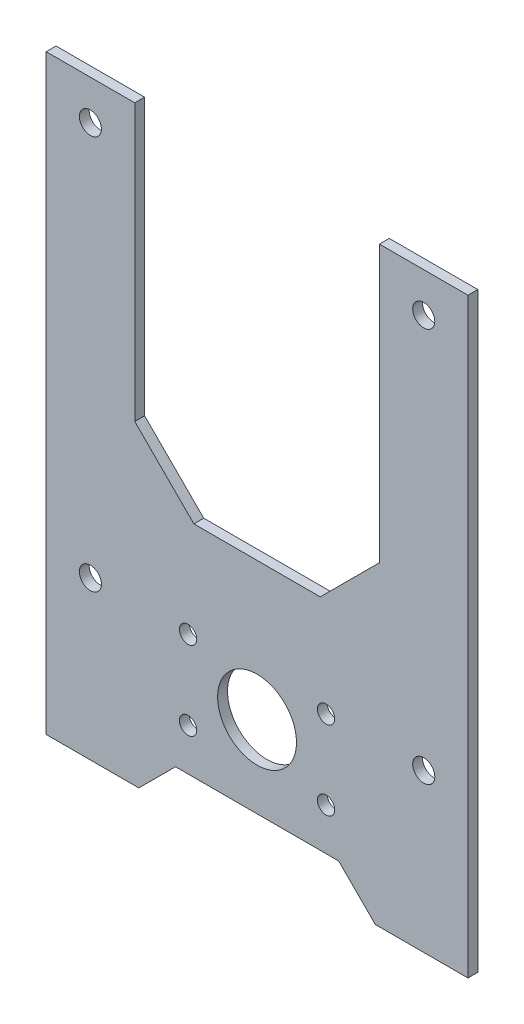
ISO-10303-21;
HEADER;
FILE_DESCRIPTION(('STEP AP214'),'2;1');
FILE_NAME('part.step','',(''),(''),'','','');
FILE_SCHEMA(('AUTOMOTIVE_DESIGN { 1 0 10303 214 1 1 1 1 }'));
ENDSEC;
DATA;
#1=APPLICATION_CONTEXT('core data for automotive mechanical design processes');
#2=APPLICATION_PROTOCOL_DEFINITION('international standard','automotive_design',2000,#1);
#3=PRODUCT_CONTEXT('',#1,'mechanical');
#4=PRODUCT('Part','Part','',(#3));
#5=PRODUCT_RELATED_PRODUCT_CATEGORY('part','',(#4));
#6=PRODUCT_DEFINITION_FORMATION('','',#4);
#7=PRODUCT_DEFINITION_CONTEXT('part definition',#1,'design');
#8=PRODUCT_DEFINITION('design','',#6,#7);
#9=PRODUCT_DEFINITION_SHAPE('','',#8);
#10=(LENGTH_UNIT() NAMED_UNIT(*) SI_UNIT(.MILLI.,.METRE.));
#11=(NAMED_UNIT(*) PLANE_ANGLE_UNIT() SI_UNIT($,.RADIAN.));
#12=(NAMED_UNIT(*) SI_UNIT($,.STERADIAN.) SOLID_ANGLE_UNIT());
#13=UNCERTAINTY_MEASURE_WITH_UNIT(LENGTH_MEASURE(1.E-05),#10,'distance_accuracy_value','');
#14=(GEOMETRIC_REPRESENTATION_CONTEXT(3) GLOBAL_UNCERTAINTY_ASSIGNED_CONTEXT((#13)) GLOBAL_UNIT_ASSIGNED_CONTEXT((#10,
#11,#12)) REPRESENTATION_CONTEXT('',''));
#15=CARTESIAN_POINT('',(0.,0.,0.));
#16=DIRECTION('',(0.,0.,1.));
#17=DIRECTION('',(1.,0.,0.));
#18=AXIS2_PLACEMENT_3D('',#15,#16,#17);
#19=CARTESIAN_POINT('',(-33.9725,-47.625,-1.5875));
#20=DIRECTION('',(0.,-1.,0.));
#21=DIRECTION('',(0.,0.,-1.));
#22=AXIS2_PLACEMENT_3D('',#19,#20,#21);
#23=PLANE('',#22);
#24=DIRECTION('',(1.,0.,0.));
#25=VECTOR('',#24,1.);
#26=CARTESIAN_POINT('',(-33.9725,-47.625,0.));
#27=LINE('',#26,#25);
#28=CARTESIAN_POINT('',(19.05,-47.6249999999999,0.));
#29=VERTEX_POINT('',#28);
#30=CARTESIAN_POINT('',(33.9725,-47.625,0.));
#31=VERTEX_POINT('',#30);
#32=EDGE_CURVE('E242',#29,#31,#27,.T.);
#33=ORIENTED_EDGE('',*,*,#32,.F.);
#34=DIRECTION('',(0.,0.,1.));
#35=VECTOR('',#34,1.);
#36=CARTESIAN_POINT('',(19.05,-47.6249999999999,-1.587512));
#37=LINE('',#36,#35);
#38=CARTESIAN_POINT('',(19.05,-47.6249999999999,-1.5875));
#39=VERTEX_POINT('',#38);
#40=EDGE_CURVE('E165',#39,#29,#37,.T.);
#41=ORIENTED_EDGE('',*,*,#40,.F.);
#42=DIRECTION('',(1.,0.,0.));
#43=VECTOR('',#42,1.);
#44=CARTESIAN_POINT('',(-33.9725,-47.625,-1.5875));
#45=LINE('',#44,#43);
#46=CARTESIAN_POINT('',(33.9725,-47.625,-1.5875));
#47=VERTEX_POINT('',#46);
#48=EDGE_CURVE('E228',#39,#47,#45,.T.);
#49=ORIENTED_EDGE('',*,*,#48,.T.);
#50=DIRECTION('',(0.,0.,1.));
#51=VECTOR('',#50,1.);
#52=CARTESIAN_POINT('',(33.9725,-47.625,-1.5875));
#53=LINE('',#52,#51);
#54=EDGE_CURVE('E245',#47,#31,#53,.T.);
#55=ORIENTED_EDGE('',*,*,#54,.T.);
#56=EDGE_LOOP('',(#33,#41,#49,#55));
#57=FACE_BOUND('',#56,.T.);
#58=ADVANCED_FACE('F40',(#57),#23,.T.);
#59=CARTESIAN_POINT('',(-33.9725,-47.625,-1.5875));
#60=VERTEX_POINT('',#59);
#61=CARTESIAN_POINT('',(-19.05,-47.6249999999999,-1.5875));
#62=VERTEX_POINT('',#61);
#63=EDGE_CURVE('E229',#60,#62,#45,.T.);
#64=ORIENTED_EDGE('',*,*,#63,.T.);
#65=DIRECTION('',(0.,0.,1.));
#66=VECTOR('',#65,1.);
#67=CARTESIAN_POINT('',(-19.05,-47.6249999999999,-1.587512));
#68=LINE('',#67,#66);
#69=CARTESIAN_POINT('',(-19.05,-47.6249999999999,0.));
#70=VERTEX_POINT('',#69);
#71=EDGE_CURVE('E275',#62,#70,#68,.T.);
#72=ORIENTED_EDGE('',*,*,#71,.T.);
#73=CARTESIAN_POINT('',(-33.9725,-47.625,0.));
#74=VERTEX_POINT('',#73);
#75=EDGE_CURVE('E221',#74,#70,#27,.T.);
#76=ORIENTED_EDGE('',*,*,#75,.F.);
#77=DIRECTION('',(0.,0.,1.));
#78=VECTOR('',#77,1.);
#79=CARTESIAN_POINT('',(-33.9725,-47.625,-1.5875));
#80=LINE('',#79,#78);
#81=EDGE_CURVE('E248',#60,#74,#80,.T.);
#82=ORIENTED_EDGE('',*,*,#81,.F.);
#83=EDGE_LOOP('',(#64,#72,#76,#82));
#84=FACE_BOUND('',#83,.T.);
#85=ADVANCED_FACE('F277',(#84),#23,.T.);
#86=CARTESIAN_POINT('',(-33.9725,47.625,-1.5875));
#87=DIRECTION('',(0.,1.,0.));
#88=DIRECTION('',(0.,0.,1.));
#89=AXIS2_PLACEMENT_3D('',#86,#87,#88);
#90=PLANE('',#89);
#91=DIRECTION('',(-1.,0.,0.));
#92=VECTOR('',#91,1.);
#93=CARTESIAN_POINT('',(-33.9725,47.625,-1.5875));
#94=LINE('',#93,#92);
#95=CARTESIAN_POINT('',(33.9725,47.625,-1.5875));
#96=VERTEX_POINT('',#95);
#97=CARTESIAN_POINT('',(19.7040499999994,47.625,-1.5875));
#98=VERTEX_POINT('',#97);
#99=EDGE_CURVE('E222',#96,#98,#94,.T.);
#100=ORIENTED_EDGE('',*,*,#99,.T.);
#101=DIRECTION('',(0.,0.,1.));
#102=VECTOR('',#101,1.);
#103=CARTESIAN_POINT('',(19.7040499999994,47.625,-1.587512));
#104=LINE('',#103,#102);
#105=CARTESIAN_POINT('',(19.7040499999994,47.625,0.));
#106=VERTEX_POINT('',#105);
#107=EDGE_CURVE('E168',#98,#106,#104,.T.);
#108=ORIENTED_EDGE('',*,*,#107,.T.);
#109=DIRECTION('',(-1.,0.,0.));
#110=VECTOR('',#109,1.);
#111=CARTESIAN_POINT('',(-33.9725,47.625,0.));
#112=LINE('',#111,#110);
#113=CARTESIAN_POINT('',(33.9725,47.625,0.));
#114=VERTEX_POINT('',#113);
#115=EDGE_CURVE('E236',#114,#106,#112,.T.);
#116=ORIENTED_EDGE('',*,*,#115,.F.);
#117=DIRECTION('',(0.,0.,1.));
#118=VECTOR('',#117,1.);
#119=CARTESIAN_POINT('',(33.9725,47.625,-1.5875));
#120=LINE('',#119,#118);
#121=EDGE_CURVE('E232',#96,#114,#120,.T.);
#122=ORIENTED_EDGE('',*,*,#121,.F.);
#123=EDGE_LOOP('',(#100,#108,#116,#122));
#124=FACE_BOUND('',#123,.T.);
#125=ADVANCED_FACE('F297',(#124),#90,.T.);
#126=CARTESIAN_POINT('',(-19.7040499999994,47.625,0.));
#127=VERTEX_POINT('',#126);
#128=CARTESIAN_POINT('',(-33.9725,47.625,0.));
#129=VERTEX_POINT('',#128);
#130=EDGE_CURVE('E235',#127,#129,#112,.T.);
#131=ORIENTED_EDGE('',*,*,#130,.F.);
#132=DIRECTION('',(0.,0.,1.));
#133=VECTOR('',#132,1.);
#134=CARTESIAN_POINT('',(-19.7040499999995,47.625,-1.587512));
#135=LINE('',#134,#133);
#136=CARTESIAN_POINT('',(-19.7040499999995,47.625,-1.5875));
#137=VERTEX_POINT('',#136);
#138=EDGE_CURVE('E63',#137,#127,#135,.T.);
#139=ORIENTED_EDGE('',*,*,#138,.F.);
#140=CARTESIAN_POINT('',(-33.9725,47.625,-1.5875));
#141=VERTEX_POINT('',#140);
#142=EDGE_CURVE('E161',#137,#141,#94,.T.);
#143=ORIENTED_EDGE('',*,*,#142,.T.);
#144=DIRECTION('',(0.,0.,1.));
#145=VECTOR('',#144,1.);
#146=CARTESIAN_POINT('',(-33.9725,47.625,-1.5875));
#147=LINE('',#146,#145);
#148=EDGE_CURVE('E250',#141,#129,#147,.T.);
#149=ORIENTED_EDGE('',*,*,#148,.T.);
#150=EDGE_LOOP('',(#131,#139,#143,#149));
#151=FACE_BOUND('',#150,.T.);
#152=ADVANCED_FACE('F334',(#151),#90,.T.);
#153=CARTESIAN_POINT('',(0.,0.,-1.5875));
#154=DIRECTION('',(0.,0.,-1.));
#155=DIRECTION('',(-1.,0.,0.));
#156=AXIS2_PLACEMENT_3D('',#153,#154,#155);
#157=PLANE('',#156);
#158=CARTESIAN_POINT('',(11.1125,-34.925,-1.5875));
#159=DIRECTION('',(0.,0.,1.));
#160=DIRECTION('',(1.,0.,0.));
#161=AXIS2_PLACEMENT_3D('',#158,#159,#160);
#162=CIRCLE('',#161,1.397);
#163=CARTESIAN_POINT('',(12.5095,-34.925,-1.5875));
#164=VERTEX_POINT('',#163);
#165=EDGE_CURVE('E617',#164,#164,#162,.T.);
#166=ORIENTED_EDGE('',*,*,#165,.T.);
#167=EDGE_LOOP('',(#166));
#168=FACE_BOUND('',#167,.T.);
#169=CARTESIAN_POINT('',(-11.1125,-22.225,-1.5875));
#170=DIRECTION('',(0.,0.,1.));
#171=DIRECTION('',(1.,0.,0.));
#172=AXIS2_PLACEMENT_3D('',#169,#170,#171);
#173=CIRCLE('',#172,1.397);
#174=CARTESIAN_POINT('',(-9.7155,-22.225,-1.5875));
#175=VERTEX_POINT('',#174);
#176=EDGE_CURVE('E621',#175,#175,#173,.T.);
#177=ORIENTED_EDGE('',*,*,#176,.T.);
#178=EDGE_LOOP('',(#177));
#179=FACE_BOUND('',#178,.T.);
#180=CARTESIAN_POINT('',(-11.1125,-34.925,-1.5875));
#181=DIRECTION('',(0.,0.,1.));
#182=DIRECTION('',(1.,0.,0.));
#183=AXIS2_PLACEMENT_3D('',#180,#181,#182);
#184=CIRCLE('',#183,1.397);
#185=CARTESIAN_POINT('',(-9.7155,-34.925,-1.5875));
#186=VERTEX_POINT('',#185);
#187=EDGE_CURVE('E632',#186,#186,#184,.T.);
#188=ORIENTED_EDGE('',*,*,#187,.T.);
#189=EDGE_LOOP('',(#188));
#190=FACE_BOUND('',#189,.T.);
#191=CARTESIAN_POINT('',(11.1125,-22.225,-1.5875));
#192=DIRECTION('',(0.,0.,1.));
#193=DIRECTION('',(1.,0.,0.));
#194=AXIS2_PLACEMENT_3D('',#191,#192,#193);
#195=CIRCLE('',#194,1.397);
#196=CARTESIAN_POINT('',(12.5095,-22.225,-1.5875));
#197=VERTEX_POINT('',#196);
#198=EDGE_CURVE('E284',#197,#197,#195,.T.);
#199=ORIENTED_EDGE('',*,*,#198,.T.);
#200=EDGE_LOOP('',(#199));
#201=FACE_BOUND('',#200,.T.);
#202=CARTESIAN_POINT('',(0.,-28.575,-1.5875));
#203=DIRECTION('',(0.,0.,1.));
#204=DIRECTION('',(1.,0.,0.));
#205=AXIS2_PLACEMENT_3D('',#202,#203,#204);
#206=CIRCLE('',#205,6.35);
#207=CARTESIAN_POINT('',(6.35000000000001,-28.575,-1.5875));
#208=VERTEX_POINT('',#207);
#209=EDGE_CURVE('E188',#208,#208,#206,.T.);
#210=ORIENTED_EDGE('',*,*,#209,.T.);
#211=EDGE_LOOP('',(#210));
#212=FACE_BOUND('',#211,.T.);
#213=CARTESIAN_POINT('',(26.8478,41.2750000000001,-1.5875));
#214=DIRECTION('',(0.,0.,1.));
#215=DIRECTION('',(1.,0.,0.));
#216=AXIS2_PLACEMENT_3D('',#213,#214,#215);
#217=CIRCLE('',#216,1.77799999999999);
#218=CARTESIAN_POINT('',(28.6258,41.2750000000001,-1.5875));
#219=VERTEX_POINT('',#218);
#220=EDGE_CURVE('E207',#219,#219,#217,.T.);
#221=ORIENTED_EDGE('',*,*,#220,.T.);
#222=EDGE_LOOP('',(#221));
#223=FACE_BOUND('',#222,.T.);
#224=CARTESIAN_POINT('',(-26.8478,41.2750000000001,-1.5875));
#225=DIRECTION('',(0.,0.,1.));
#226=DIRECTION('',(1.,0.,0.));
#227=AXIS2_PLACEMENT_3D('',#224,#225,#226);
#228=CIRCLE('',#227,1.778);
#229=CARTESIAN_POINT('',(-25.0698,41.2750000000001,-1.5875));
#230=VERTEX_POINT('',#229);
#231=EDGE_CURVE('E201',#230,#230,#228,.T.);
#232=ORIENTED_EDGE('',*,*,#231,.T.);
#233=EDGE_LOOP('',(#232));
#234=FACE_BOUND('',#233,.T.);
#235=CARTESIAN_POINT('',(-26.8478,-22.2249999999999,-1.5875));
#236=DIRECTION('',(0.,0.,1.));
#237=DIRECTION('',(1.,0.,0.));
#238=AXIS2_PLACEMENT_3D('',#235,#236,#237);
#239=CIRCLE('',#238,1.77799999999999);
#240=CARTESIAN_POINT('',(-25.0698,-22.2249999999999,-1.5875));
#241=VERTEX_POINT('',#240);
#242=EDGE_CURVE('E194',#241,#241,#239,.T.);
#243=ORIENTED_EDGE('',*,*,#242,.T.);
#244=EDGE_LOOP('',(#243));
#245=FACE_BOUND('',#244,.T.);
#246=CARTESIAN_POINT('',(26.8478,-22.2249999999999,-1.5875));
#247=DIRECTION('',(0.,0.,1.));
#248=DIRECTION('',(1.,0.,0.));
#249=AXIS2_PLACEMENT_3D('',#246,#247,#248);
#250=CIRCLE('',#249,1.77799999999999);
#251=CARTESIAN_POINT('',(28.6258,-22.2249999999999,-1.5875));
#252=VERTEX_POINT('',#251);
#253=EDGE_CURVE('E212',#252,#252,#250,.T.);
#254=ORIENTED_EDGE('',*,*,#253,.T.);
#255=EDGE_LOOP('',(#254));
#256=FACE_BOUND('',#255,.T.);
#257=ORIENTED_EDGE('',*,*,#48,.F.);
#258=DIRECTION('',(-0.707106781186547,0.707106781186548,0.));
#259=VECTOR('',#258,1.);
#260=CARTESIAN_POINT('',(-14.2875,-14.2874999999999,-1.5875));
#261=LINE('',#260,#259);
#262=CARTESIAN_POINT('',(13.1383466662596,-41.7133466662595,-1.5875));
#263=VERTEX_POINT('',#262);
#264=EDGE_CURVE('E181',#39,#263,#261,.T.);
#265=ORIENTED_EDGE('',*,*,#264,.T.);
#266=DIRECTION('',(-1.,0.,0.));
#267=VECTOR('',#266,1.);
#268=CARTESIAN_POINT('',(0.,-41.7133466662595,-1.5875));
#269=LINE('',#268,#267);
#270=CARTESIAN_POINT('',(-13.1383466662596,-41.7133466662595,-1.5875));
#271=VERTEX_POINT('',#270);
#272=EDGE_CURVE('E184',#263,#271,#269,.T.);
#273=ORIENTED_EDGE('',*,*,#272,.T.);
#274=DIRECTION('',(-0.707106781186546,-0.707106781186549,0.));
#275=VECTOR('',#274,1.);
#276=CARTESIAN_POINT('',(14.2874999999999,-14.2874999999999,-1.5875));
#277=LINE('',#276,#275);
#278=EDGE_CURVE('E178',#271,#62,#277,.T.);
#279=ORIENTED_EDGE('',*,*,#278,.T.);
#280=ORIENTED_EDGE('',*,*,#63,.F.);
#281=DIRECTION('',(0.,-1.,0.));
#282=VECTOR('',#281,1.);
#283=CARTESIAN_POINT('',(-33.9725,-47.625,-1.5875));
#284=LINE('',#283,#282);
#285=EDGE_CURVE('E225',#141,#60,#284,.T.);
#286=ORIENTED_EDGE('',*,*,#285,.F.);
#287=ORIENTED_EDGE('',*,*,#142,.F.);
#288=DIRECTION('',(0.,-1.,0.));
#289=VECTOR('',#288,1.);
#290=CARTESIAN_POINT('',(-19.7040499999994,0.,-1.5875));
#291=LINE('',#290,#289);
#292=CARTESIAN_POINT('',(-19.7040499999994,3.17499999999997,-1.5875));
#293=VERTEX_POINT('',#292);
#294=EDGE_CURVE('E152',#137,#293,#291,.T.);
#295=ORIENTED_EDGE('',*,*,#294,.T.);
#296=DIRECTION('',(0.707106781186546,-0.707106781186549,0.));
#297=VECTOR('',#296,1.);
#298=CARTESIAN_POINT('',(-8.26452499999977,-8.26452499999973,-1.5875));
#299=LINE('',#298,#297);
#300=CARTESIAN_POINT('',(-10.1790499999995,-6.34999999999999,-1.5875));
#301=VERTEX_POINT('',#300);
#302=EDGE_CURVE('E141',#293,#301,#299,.T.);
#303=ORIENTED_EDGE('',*,*,#302,.T.);
#304=DIRECTION('',(1.,0.,0.));
#305=VECTOR('',#304,1.);
#306=CARTESIAN_POINT('',(0.,-6.34999999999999,-1.5875));
#307=LINE('',#306,#305);
#308=CARTESIAN_POINT('',(10.1790499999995,-6.34999999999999,-1.5875));
#309=VERTEX_POINT('',#308);
#310=EDGE_CURVE('E151',#301,#309,#307,.T.);
#311=ORIENTED_EDGE('',*,*,#310,.T.);
#312=DIRECTION('',(0.707106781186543,0.707106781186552,0.));
#313=VECTOR('',#312,1.);
#314=CARTESIAN_POINT('',(8.26452499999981,-8.2645249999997,-1.5875));
#315=LINE('',#314,#313);
#316=CARTESIAN_POINT('',(19.7040499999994,3.175,-1.5875));
#317=VERTEX_POINT('',#316);
#318=EDGE_CURVE('E172',#309,#317,#315,.T.);
#319=ORIENTED_EDGE('',*,*,#318,.T.);
#320=DIRECTION('',(0.,1.,0.));
#321=VECTOR('',#320,1.);
#322=CARTESIAN_POINT('',(19.7040499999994,0.,-1.5875));
#323=LINE('',#322,#321);
#324=EDGE_CURVE('E175',#317,#98,#323,.T.);
#325=ORIENTED_EDGE('',*,*,#324,.T.);
#326=ORIENTED_EDGE('',*,*,#99,.F.);
#327=DIRECTION('',(0.,1.,0.));
#328=VECTOR('',#327,1.);
#329=CARTESIAN_POINT('',(33.9725,-47.625,-1.5875));
#330=LINE('',#329,#328);
#331=EDGE_CURVE('E218',#47,#96,#330,.T.);
#332=ORIENTED_EDGE('',*,*,#331,.F.);
#333=EDGE_LOOP('',(#257,#265,#273,#279,#280,#286,#287,#295,#303,#311,#319,#325,#326,#332));
#334=FACE_BOUND('',#333,.T.);
#335=ADVANCED_FACE('F159',(#168,#179,#190,#201,#212,#223,#234,#245,#256,#334),#157,.T.);
#336=CARTESIAN_POINT('',(0.,0.,0.));
#337=DIRECTION('',(0.,0.,-1.));
#338=DIRECTION('',(-1.,0.,0.));
#339=AXIS2_PLACEMENT_3D('',#336,#337,#338);
#340=PLANE('',#339);
#341=CARTESIAN_POINT('',(11.1125,-34.925,0.));
#342=DIRECTION('',(0.,0.,1.));
#343=DIRECTION('',(1.,0.,0.));
#344=AXIS2_PLACEMENT_3D('',#341,#342,#343);
#345=CIRCLE('',#344,1.397);
#346=CARTESIAN_POINT('',(12.5095,-34.925,0.));
#347=VERTEX_POINT('',#346);
#348=EDGE_CURVE('E620',#347,#347,#345,.T.);
#349=ORIENTED_EDGE('',*,*,#348,.F.);
#350=EDGE_LOOP('',(#349));
#351=FACE_BOUND('',#350,.T.);
#352=CARTESIAN_POINT('',(-11.1125,-22.225,0.));
#353=DIRECTION('',(0.,0.,1.));
#354=DIRECTION('',(1.,0.,0.));
#355=AXIS2_PLACEMENT_3D('',#352,#353,#354);
#356=CIRCLE('',#355,1.397);
#357=CARTESIAN_POINT('',(-9.7155,-22.225,0.));
#358=VERTEX_POINT('',#357);
#359=EDGE_CURVE('E626',#358,#358,#356,.T.);
#360=ORIENTED_EDGE('',*,*,#359,.F.);
#361=EDGE_LOOP('',(#360));
#362=FACE_BOUND('',#361,.T.);
#363=CARTESIAN_POINT('',(-11.1125,-34.925,0.));
#364=DIRECTION('',(0.,0.,1.));
#365=DIRECTION('',(1.,0.,0.));
#366=AXIS2_PLACEMENT_3D('',#363,#364,#365);
#367=CIRCLE('',#366,1.397);
#368=CARTESIAN_POINT('',(-9.7155,-34.925,0.));
#369=VERTEX_POINT('',#368);
#370=EDGE_CURVE('E643',#369,#369,#367,.T.);
#371=ORIENTED_EDGE('',*,*,#370,.F.);
#372=EDGE_LOOP('',(#371));
#373=FACE_BOUND('',#372,.T.);
#374=CARTESIAN_POINT('',(11.1125,-22.225,0.));
#375=DIRECTION('',(0.,0.,1.));
#376=DIRECTION('',(1.,0.,0.));
#377=AXIS2_PLACEMENT_3D('',#374,#375,#376);
#378=CIRCLE('',#377,1.397);
#379=CARTESIAN_POINT('',(12.5095,-22.225,0.));
#380=VERTEX_POINT('',#379);
#381=EDGE_CURVE('E623',#380,#380,#378,.T.);
#382=ORIENTED_EDGE('',*,*,#381,.F.);
#383=EDGE_LOOP('',(#382));
#384=FACE_BOUND('',#383,.T.);
#385=CARTESIAN_POINT('',(0.,-28.575,0.));
#386=DIRECTION('',(0.,0.,1.));
#387=DIRECTION('',(1.,0.,0.));
#388=AXIS2_PLACEMENT_3D('',#385,#386,#387);
#389=CIRCLE('',#388,6.35);
#390=CARTESIAN_POINT('',(6.35000000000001,-28.575,0.));
#391=VERTEX_POINT('',#390);
#392=EDGE_CURVE('E187',#391,#391,#389,.T.);
#393=ORIENTED_EDGE('',*,*,#392,.F.);
#394=EDGE_LOOP('',(#393));
#395=FACE_BOUND('',#394,.T.);
#396=CARTESIAN_POINT('',(26.8478,41.2750000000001,0.));
#397=DIRECTION('',(0.,0.,1.));
#398=DIRECTION('',(1.,0.,0.));
#399=AXIS2_PLACEMENT_3D('',#396,#397,#398);
#400=CIRCLE('',#399,1.77799999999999);
#401=CARTESIAN_POINT('',(28.6258,41.2750000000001,0.));
#402=VERTEX_POINT('',#401);
#403=EDGE_CURVE('E191',#402,#402,#400,.T.);
#404=ORIENTED_EDGE('',*,*,#403,.F.);
#405=EDGE_LOOP('',(#404));
#406=FACE_BOUND('',#405,.T.);
#407=CARTESIAN_POINT('',(-26.8478,41.2750000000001,0.));
#408=DIRECTION('',(0.,0.,1.));
#409=DIRECTION('',(1.,0.,0.));
#410=AXIS2_PLACEMENT_3D('',#407,#408,#409);
#411=CIRCLE('',#410,1.778);
#412=CARTESIAN_POINT('',(-25.0698,41.2750000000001,0.));
#413=VERTEX_POINT('',#412);
#414=EDGE_CURVE('E204',#413,#413,#411,.T.);
#415=ORIENTED_EDGE('',*,*,#414,.F.);
#416=EDGE_LOOP('',(#415));
#417=FACE_BOUND('',#416,.T.);
#418=CARTESIAN_POINT('',(-26.8478,-22.2249999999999,0.));
#419=DIRECTION('',(0.,0.,1.));
#420=DIRECTION('',(1.,0.,0.));
#421=AXIS2_PLACEMENT_3D('',#418,#419,#420);
#422=CIRCLE('',#421,1.77799999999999);
#423=CARTESIAN_POINT('',(-25.0698,-22.2249999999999,0.));
#424=VERTEX_POINT('',#423);
#425=EDGE_CURVE('E198',#424,#424,#422,.T.);
#426=ORIENTED_EDGE('',*,*,#425,.F.);
#427=EDGE_LOOP('',(#426));
#428=FACE_BOUND('',#427,.T.);
#429=CARTESIAN_POINT('',(26.8478,-22.2249999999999,0.));
#430=DIRECTION('',(0.,0.,1.));
#431=DIRECTION('',(1.,0.,0.));
#432=AXIS2_PLACEMENT_3D('',#429,#430,#431);
#433=CIRCLE('',#432,1.77799999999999);
#434=CARTESIAN_POINT('',(28.6258,-22.2249999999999,0.));
#435=VERTEX_POINT('',#434);
#436=EDGE_CURVE('E197',#435,#435,#433,.T.);
#437=ORIENTED_EDGE('',*,*,#436,.F.);
#438=EDGE_LOOP('',(#437));
#439=FACE_BOUND('',#438,.T.);
#440=DIRECTION('',(-0.707106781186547,0.707106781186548,0.));
#441=VECTOR('',#440,1.);
#442=CARTESIAN_POINT('',(-14.2875,-14.2874999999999,0.));
#443=LINE('',#442,#441);
#444=CARTESIAN_POINT('',(13.1383466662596,-41.7133466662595,0.));
#445=VERTEX_POINT('',#444);
#446=EDGE_CURVE('E11',#29,#445,#443,.T.);
#447=ORIENTED_EDGE('',*,*,#446,.F.);
#448=ORIENTED_EDGE('',*,*,#32,.T.);
#449=DIRECTION('',(0.,1.,0.));
#450=VECTOR('',#449,1.);
#451=CARTESIAN_POINT('',(33.9725,-47.625,0.));
#452=LINE('',#451,#450);
#453=EDGE_CURVE('E215',#31,#114,#452,.T.);
#454=ORIENTED_EDGE('',*,*,#453,.T.);
#455=ORIENTED_EDGE('',*,*,#115,.T.);
#456=DIRECTION('',(0.,1.,0.));
#457=VECTOR('',#456,1.);
#458=CARTESIAN_POINT('',(19.7040499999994,0.,0.));
#459=LINE('',#458,#457);
#460=CARTESIAN_POINT('',(19.7040499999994,3.175,0.));
#461=VERTEX_POINT('',#460);
#462=EDGE_CURVE('E261',#461,#106,#459,.T.);
#463=ORIENTED_EDGE('',*,*,#462,.F.);
#464=DIRECTION('',(0.707106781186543,0.707106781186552,0.));
#465=VECTOR('',#464,1.);
#466=CARTESIAN_POINT('',(8.26452499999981,-8.2645249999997,0.));
#467=LINE('',#466,#465);
#468=CARTESIAN_POINT('',(10.1790499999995,-6.34999999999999,0.));
#469=VERTEX_POINT('',#468);
#470=EDGE_CURVE('E259',#469,#461,#467,.T.);
#471=ORIENTED_EDGE('',*,*,#470,.F.);
#472=DIRECTION('',(1.,0.,0.));
#473=VECTOR('',#472,1.);
#474=CARTESIAN_POINT('',(0.,-6.34999999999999,0.));
#475=LINE('',#474,#473);
#476=CARTESIAN_POINT('',(-10.1790499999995,-6.34999999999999,0.));
#477=VERTEX_POINT('',#476);
#478=EDGE_CURVE('E257',#477,#469,#475,.T.);
#479=ORIENTED_EDGE('',*,*,#478,.F.);
#480=DIRECTION('',(0.707106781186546,-0.707106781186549,0.));
#481=VECTOR('',#480,1.);
#482=CARTESIAN_POINT('',(-8.26452499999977,-8.26452499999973,0.));
#483=LINE('',#482,#481);
#484=CARTESIAN_POINT('',(-19.7040499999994,3.17499999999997,0.));
#485=VERTEX_POINT('',#484);
#486=EDGE_CURVE('E255',#485,#477,#483,.T.);
#487=ORIENTED_EDGE('',*,*,#486,.F.);
#488=DIRECTION('',(0.,-1.,0.));
#489=VECTOR('',#488,1.);
#490=CARTESIAN_POINT('',(-19.7040499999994,0.,0.));
#491=LINE('',#490,#489);
#492=EDGE_CURVE('E155',#127,#485,#491,.T.);
#493=ORIENTED_EDGE('',*,*,#492,.F.);
#494=ORIENTED_EDGE('',*,*,#130,.T.);
#495=DIRECTION('',(0.,-1.,0.));
#496=VECTOR('',#495,1.);
#497=CARTESIAN_POINT('',(-33.9725,-47.625,0.));
#498=LINE('',#497,#496);
#499=EDGE_CURVE('E239',#129,#74,#498,.T.);
#500=ORIENTED_EDGE('',*,*,#499,.T.);
#501=ORIENTED_EDGE('',*,*,#75,.T.);
#502=DIRECTION('',(-0.707106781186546,-0.707106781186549,0.));
#503=VECTOR('',#502,1.);
#504=CARTESIAN_POINT('',(14.2874999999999,-14.2874999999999,0.));
#505=LINE('',#504,#503);
#506=CARTESIAN_POINT('',(-13.1383466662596,-41.7133466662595,0.));
#507=VERTEX_POINT('',#506);
#508=EDGE_CURVE('E263',#507,#70,#505,.T.);
#509=ORIENTED_EDGE('',*,*,#508,.F.);
#510=DIRECTION('',(-1.,0.,0.));
#511=VECTOR('',#510,1.);
#512=CARTESIAN_POINT('',(0.,-41.7133466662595,0.));
#513=LINE('',#512,#511);
#514=EDGE_CURVE('E48',#445,#507,#513,.T.);
#515=ORIENTED_EDGE('',*,*,#514,.F.);
#516=EDGE_LOOP('',(#447,#448,#454,#455,#463,#471,#479,#487,#493,#494,#500,#501,#509,#515));
#517=FACE_BOUND('',#516,.T.);
#518=ADVANCED_FACE('F271',(#351,#362,#373,#384,#395,#406,#417,#428,#439,#517),#340,.F.);
#519=CARTESIAN_POINT('',(33.9725,-47.625,-1.5875));
#520=DIRECTION('',(1.,0.,0.));
#521=DIRECTION('',(0.,0.,-1.));
#522=AXIS2_PLACEMENT_3D('',#519,#520,#521);
#523=PLANE('',#522);
#524=ORIENTED_EDGE('',*,*,#453,.F.);
#525=ORIENTED_EDGE('',*,*,#54,.F.);
#526=ORIENTED_EDGE('',*,*,#331,.T.);
#527=ORIENTED_EDGE('',*,*,#121,.T.);
#528=EDGE_LOOP('',(#524,#525,#526,#527));
#529=FACE_BOUND('',#528,.T.);
#530=ADVANCED_FACE('F42',(#529),#523,.T.);
#531=CARTESIAN_POINT('',(-33.9725,-47.625,-1.5875));
#532=DIRECTION('',(-1.,0.,0.));
#533=DIRECTION('',(0.,0.,1.));
#534=AXIS2_PLACEMENT_3D('',#531,#532,#533);
#535=PLANE('',#534);
#536=ORIENTED_EDGE('',*,*,#499,.F.);
#537=ORIENTED_EDGE('',*,*,#148,.F.);
#538=ORIENTED_EDGE('',*,*,#285,.T.);
#539=ORIENTED_EDGE('',*,*,#81,.T.);
#540=EDGE_LOOP('',(#536,#537,#538,#539));
#541=FACE_BOUND('',#540,.T.);
#542=ADVANCED_FACE('F329',(#541),#535,.T.);
#543=CARTESIAN_POINT('',(26.8478,-22.2249999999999,-1.5875));
#544=DIRECTION('',(0.,0.,1.));
#545=DIRECTION('',(1.,0.,0.));
#546=AXIS2_PLACEMENT_3D('',#543,#544,#545);
#547=CYLINDRICAL_SURFACE('',#546,1.77799999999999);
#548=ORIENTED_EDGE('',*,*,#253,.F.);
#549=EDGE_LOOP('',(#548));
#550=FACE_BOUND('',#549,.T.);
#551=ORIENTED_EDGE('',*,*,#436,.T.);
#552=EDGE_LOOP('',(#551));
#553=FACE_BOUND('',#552,.T.);
#554=ADVANCED_FACE('F331',(#550,#553),#547,.F.);
#555=CARTESIAN_POINT('',(-26.8478,-22.2249999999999,-1.5875));
#556=DIRECTION('',(0.,0.,1.));
#557=DIRECTION('',(1.,0.,0.));
#558=AXIS2_PLACEMENT_3D('',#555,#556,#557);
#559=CYLINDRICAL_SURFACE('',#558,1.77799999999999);
#560=ORIENTED_EDGE('',*,*,#242,.F.);
#561=EDGE_LOOP('',(#560));
#562=FACE_BOUND('',#561,.T.);
#563=ORIENTED_EDGE('',*,*,#425,.T.);
#564=EDGE_LOOP('',(#563));
#565=FACE_BOUND('',#564,.T.);
#566=ADVANCED_FACE('F533',(#562,#565),#559,.F.);
#567=CARTESIAN_POINT('',(-26.8478,41.2750000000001,-1.5875));
#568=DIRECTION('',(0.,0.,1.));
#569=DIRECTION('',(1.,0.,0.));
#570=AXIS2_PLACEMENT_3D('',#567,#568,#569);
#571=CYLINDRICAL_SURFACE('',#570,1.778);
#572=ORIENTED_EDGE('',*,*,#231,.F.);
#573=EDGE_LOOP('',(#572));
#574=FACE_BOUND('',#573,.T.);
#575=ORIENTED_EDGE('',*,*,#414,.T.);
#576=EDGE_LOOP('',(#575));
#577=FACE_BOUND('',#576,.T.);
#578=ADVANCED_FACE('F523',(#574,#577),#571,.F.);
#579=CARTESIAN_POINT('',(26.8478,41.2750000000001,-1.5875));
#580=DIRECTION('',(0.,0.,1.));
#581=DIRECTION('',(1.,0.,0.));
#582=AXIS2_PLACEMENT_3D('',#579,#580,#581);
#583=CYLINDRICAL_SURFACE('',#582,1.77799999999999);
#584=ORIENTED_EDGE('',*,*,#220,.F.);
#585=EDGE_LOOP('',(#584));
#586=FACE_BOUND('',#585,.T.);
#587=ORIENTED_EDGE('',*,*,#403,.T.);
#588=EDGE_LOOP('',(#587));
#589=FACE_BOUND('',#588,.T.);
#590=ADVANCED_FACE('F514',(#586,#589),#583,.F.);
#591=CARTESIAN_POINT('',(0.,-28.575,-1.5875));
#592=DIRECTION('',(0.,0.,1.));
#593=DIRECTION('',(1.,0.,0.));
#594=AXIS2_PLACEMENT_3D('',#591,#592,#593);
#595=CYLINDRICAL_SURFACE('',#594,6.35);
#596=ORIENTED_EDGE('',*,*,#209,.F.);
#597=EDGE_LOOP('',(#596));
#598=FACE_BOUND('',#597,.T.);
#599=ORIENTED_EDGE('',*,*,#392,.T.);
#600=EDGE_LOOP('',(#599));
#601=FACE_BOUND('',#600,.T.);
#602=ADVANCED_FACE('F479',(#598,#601),#595,.F.);
#603=CARTESIAN_POINT('',(19.7040499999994,3.175,-1.587512));
#604=DIRECTION('',(-1.,0.,0.));
#605=DIRECTION('',(0.,0.,1.));
#606=AXIS2_PLACEMENT_3D('',#603,#604,#605);
#607=PLANE('',#606);
#608=DIRECTION('',(0.,0.,1.));
#609=VECTOR('',#608,1.);
#610=CARTESIAN_POINT('',(19.7040499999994,3.175,-1.587512));
#611=LINE('',#610,#609);
#612=EDGE_CURVE('E289',#317,#461,#611,.T.);
#613=ORIENTED_EDGE('',*,*,#612,.T.);
#614=ORIENTED_EDGE('',*,*,#462,.T.);
#615=ORIENTED_EDGE('',*,*,#107,.F.);
#616=ORIENTED_EDGE('',*,*,#324,.F.);
#617=EDGE_LOOP('',(#613,#614,#615,#616));
#618=FACE_BOUND('',#617,.T.);
#619=ADVANCED_FACE('F305',(#618),#607,.T.);
#620=CARTESIAN_POINT('',(19.7040499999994,3.175,-1.587512));
#621=DIRECTION('',(-0.707106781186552,0.707106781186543,0.));
#622=DIRECTION('',(-0.707106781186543,-0.707106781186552,0.));
#623=AXIS2_PLACEMENT_3D('',#620,#621,#622);
#624=PLANE('',#623);
#625=DIRECTION('',(0.,0.,1.));
#626=VECTOR('',#625,1.);
#627=CARTESIAN_POINT('',(10.1790499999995,-6.34999999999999,-1.587512));
#628=LINE('',#627,#626);
#629=EDGE_CURVE('E287',#309,#469,#628,.T.);
#630=ORIENTED_EDGE('',*,*,#629,.T.);
#631=ORIENTED_EDGE('',*,*,#470,.T.);
#632=ORIENTED_EDGE('',*,*,#612,.F.);
#633=ORIENTED_EDGE('',*,*,#318,.F.);
#634=EDGE_LOOP('',(#630,#631,#632,#633));
#635=FACE_BOUND('',#634,.T.);
#636=ADVANCED_FACE('F307',(#635),#624,.T.);
#637=CARTESIAN_POINT('',(-10.1790499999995,-6.34999999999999,-1.587512));
#638=DIRECTION('',(0.,1.,0.));
#639=DIRECTION('',(0.,0.,1.));
#640=AXIS2_PLACEMENT_3D('',#637,#638,#639);
#641=PLANE('',#640);
#642=DIRECTION('',(0.,0.,1.));
#643=VECTOR('',#642,1.);
#644=CARTESIAN_POINT('',(-10.1790499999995,-6.34999999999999,-1.587512));
#645=LINE('',#644,#643);
#646=EDGE_CURVE('E147',#301,#477,#645,.T.);
#647=ORIENTED_EDGE('',*,*,#646,.T.);
#648=ORIENTED_EDGE('',*,*,#478,.T.);
#649=ORIENTED_EDGE('',*,*,#629,.F.);
#650=ORIENTED_EDGE('',*,*,#310,.F.);
#651=EDGE_LOOP('',(#647,#648,#649,#650));
#652=FACE_BOUND('',#651,.T.);
#653=ADVANCED_FACE('F311',(#652),#641,.T.);
#654=CARTESIAN_POINT('',(-19.7040499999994,3.17499999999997,-1.587512));
#655=DIRECTION('',(0.707106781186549,0.707106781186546,0.));
#656=DIRECTION('',(-0.707106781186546,0.707106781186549,0.));
#657=AXIS2_PLACEMENT_3D('',#654,#655,#656);
#658=PLANE('',#657);
#659=DIRECTION('',(0.,0.,1.));
#660=VECTOR('',#659,1.);
#661=CARTESIAN_POINT('',(-19.7040499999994,3.17499999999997,-1.587512));
#662=LINE('',#661,#660);
#663=EDGE_CURVE('E144',#293,#485,#662,.T.);
#664=ORIENTED_EDGE('',*,*,#663,.T.);
#665=ORIENTED_EDGE('',*,*,#486,.T.);
#666=ORIENTED_EDGE('',*,*,#646,.F.);
#667=ORIENTED_EDGE('',*,*,#302,.F.);
#668=EDGE_LOOP('',(#664,#665,#666,#667));
#669=FACE_BOUND('',#668,.T.);
#670=ADVANCED_FACE('F143',(#669),#658,.T.);
#671=CARTESIAN_POINT('',(-19.7040499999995,47.625,-1.587512));
#672=DIRECTION('',(1.,0.,0.));
#673=DIRECTION('',(0.,1.,0.));
#674=AXIS2_PLACEMENT_3D('',#671,#672,#673);
#675=PLANE('',#674);
#676=ORIENTED_EDGE('',*,*,#138,.T.);
#677=ORIENTED_EDGE('',*,*,#492,.T.);
#678=ORIENTED_EDGE('',*,*,#663,.F.);
#679=ORIENTED_EDGE('',*,*,#294,.F.);
#680=EDGE_LOOP('',(#676,#677,#678,#679));
#681=FACE_BOUND('',#680,.T.);
#682=ADVANCED_FACE('F154',(#681),#675,.T.);
#683=CARTESIAN_POINT('',(13.1383466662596,-41.7133466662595,-1.587512));
#684=DIRECTION('',(0.,-1.,0.));
#685=DIRECTION('',(1.,0.,0.));
#686=AXIS2_PLACEMENT_3D('',#683,#684,#685);
#687=PLANE('',#686);
#688=DIRECTION('',(0.,0.,1.));
#689=VECTOR('',#688,1.);
#690=CARTESIAN_POINT('',(13.1383466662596,-41.7133466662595,-1.587512));
#691=LINE('',#690,#689);
#692=EDGE_CURVE('E162',#263,#445,#691,.T.);
#693=ORIENTED_EDGE('',*,*,#692,.T.);
#694=ORIENTED_EDGE('',*,*,#514,.T.);
#695=DIRECTION('',(0.,0.,1.));
#696=VECTOR('',#695,1.);
#697=CARTESIAN_POINT('',(-13.1383466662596,-41.7133466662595,-1.587512));
#698=LINE('',#697,#696);
#699=EDGE_CURVE('E55',#271,#507,#698,.T.);
#700=ORIENTED_EDGE('',*,*,#699,.F.);
#701=ORIENTED_EDGE('',*,*,#272,.F.);
#702=EDGE_LOOP('',(#693,#694,#700,#701));
#703=FACE_BOUND('',#702,.T.);
#704=ADVANCED_FACE('F267',(#703),#687,.T.);
#705=CARTESIAN_POINT('',(19.05,-47.6249999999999,-1.587512));
#706=DIRECTION('',(-0.707106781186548,-0.707106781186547,0.));
#707=DIRECTION('',(0.707106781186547,-0.707106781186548,0.));
#708=AXIS2_PLACEMENT_3D('',#705,#706,#707);
#709=PLANE('',#708);
#710=ORIENTED_EDGE('',*,*,#40,.T.);
#711=ORIENTED_EDGE('',*,*,#446,.T.);
#712=ORIENTED_EDGE('',*,*,#692,.F.);
#713=ORIENTED_EDGE('',*,*,#264,.F.);
#714=EDGE_LOOP('',(#710,#711,#712,#713));
#715=FACE_BOUND('',#714,.T.);
#716=ADVANCED_FACE('F347',(#715),#709,.T.);
#717=CARTESIAN_POINT('',(-13.1383466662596,-41.7133466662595,-1.587512));
#718=DIRECTION('',(0.707106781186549,-0.707106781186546,0.));
#719=DIRECTION('',(0.707106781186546,0.707106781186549,0.));
#720=AXIS2_PLACEMENT_3D('',#717,#718,#719);
#721=PLANE('',#720);
#722=ORIENTED_EDGE('',*,*,#699,.T.);
#723=ORIENTED_EDGE('',*,*,#508,.T.);
#724=ORIENTED_EDGE('',*,*,#71,.F.);
#725=ORIENTED_EDGE('',*,*,#278,.F.);
#726=EDGE_LOOP('',(#722,#723,#724,#725));
#727=FACE_BOUND('',#726,.T.);
#728=ADVANCED_FACE('F274',(#727),#721,.T.);
#729=CARTESIAN_POINT('',(11.1125,-22.225,-1.5875));
#730=DIRECTION('',(0.,0.,1.));
#731=DIRECTION('',(1.,0.,0.));
#732=AXIS2_PLACEMENT_3D('',#729,#730,#731);
#733=CYLINDRICAL_SURFACE('',#732,1.397);
#734=ORIENTED_EDGE('',*,*,#198,.F.);
#735=EDGE_LOOP('',(#734));
#736=FACE_BOUND('',#735,.T.);
#737=ORIENTED_EDGE('',*,*,#381,.T.);
#738=EDGE_LOOP('',(#737));
#739=FACE_BOUND('',#738,.T.);
#740=ADVANCED_FACE('F355',(#736,#739),#733,.F.);
#741=CARTESIAN_POINT('',(-11.1125,-34.925,-1.5875));
#742=DIRECTION('',(0.,0.,1.));
#743=DIRECTION('',(1.,0.,0.));
#744=AXIS2_PLACEMENT_3D('',#741,#742,#743);
#745=CYLINDRICAL_SURFACE('',#744,1.397);
#746=ORIENTED_EDGE('',*,*,#187,.F.);
#747=EDGE_LOOP('',(#746));
#748=FACE_BOUND('',#747,.T.);
#749=ORIENTED_EDGE('',*,*,#370,.T.);
#750=EDGE_LOOP('',(#749));
#751=FACE_BOUND('',#750,.T.);
#752=ADVANCED_FACE('F410',(#748,#751),#745,.F.);
#753=CARTESIAN_POINT('',(-11.1125,-22.225,-1.5875));
#754=DIRECTION('',(0.,0.,1.));
#755=DIRECTION('',(1.,0.,0.));
#756=AXIS2_PLACEMENT_3D('',#753,#754,#755);
#757=CYLINDRICAL_SURFACE('',#756,1.397);
#758=ORIENTED_EDGE('',*,*,#176,.F.);
#759=EDGE_LOOP('',(#758));
#760=FACE_BOUND('',#759,.T.);
#761=ORIENTED_EDGE('',*,*,#359,.T.);
#762=EDGE_LOOP('',(#761));
#763=FACE_BOUND('',#762,.T.);
#764=ADVANCED_FACE('F420',(#760,#763),#757,.F.);
#765=CARTESIAN_POINT('',(11.1125,-34.925,-1.5875));
#766=DIRECTION('',(0.,0.,1.));
#767=DIRECTION('',(1.,0.,0.));
#768=AXIS2_PLACEMENT_3D('',#765,#766,#767);
#769=CYLINDRICAL_SURFACE('',#768,1.397);
#770=ORIENTED_EDGE('',*,*,#165,.F.);
#771=EDGE_LOOP('',(#770));
#772=FACE_BOUND('',#771,.T.);
#773=ORIENTED_EDGE('',*,*,#348,.T.);
#774=EDGE_LOOP('',(#773));
#775=FACE_BOUND('',#774,.T.);
#776=ADVANCED_FACE('F431',(#772,#775),#769,.F.);
#777=CLOSED_SHELL('',(#58,#85,#125,#152,#335,#518,#530,#542,#554,#566,#578,#590,#602,#619,#636,
#653,#670,#682,#704,#716,#728,#740,#752,#764,#776));
#778=MANIFOLD_SOLID_BREP('B2',#777);
#779=ADVANCED_BREP_SHAPE_REPRESENTATION('',(#18,#778),#14);
#780=SHAPE_DEFINITION_REPRESENTATION(#9,#779);
ENDSEC;
END-ISO-10303-21;
